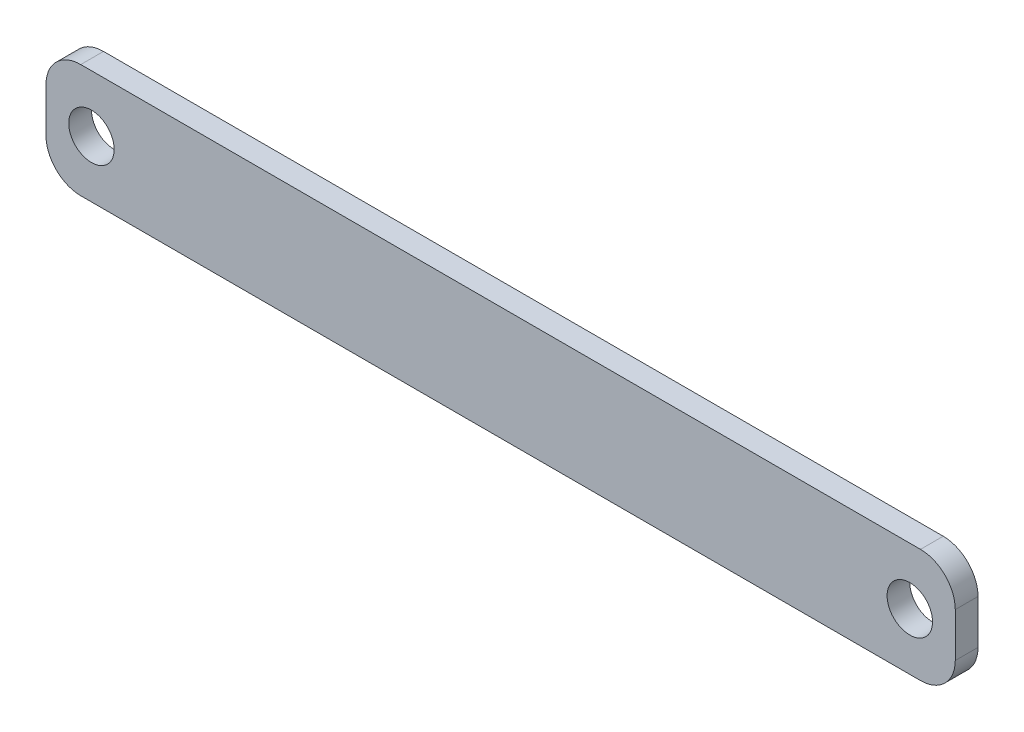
ISO-10303-21;
HEADER;
FILE_DESCRIPTION(('STEP AP214'),'2;1');
FILE_NAME('part.step','',(''),(''),'','','');
FILE_SCHEMA(('AUTOMOTIVE_DESIGN { 1 0 10303 214 1 1 1 1 }'));
ENDSEC;
DATA;
#1=APPLICATION_CONTEXT('core data for automotive mechanical design processes');
#2=APPLICATION_PROTOCOL_DEFINITION('international standard','automotive_design',2000,#1);
#3=PRODUCT_CONTEXT('',#1,'mechanical');
#4=PRODUCT('Part','Part','',(#3));
#5=PRODUCT_RELATED_PRODUCT_CATEGORY('part','',(#4));
#6=PRODUCT_DEFINITION_FORMATION('','',#4);
#7=PRODUCT_DEFINITION_CONTEXT('part definition',#1,'design');
#8=PRODUCT_DEFINITION('design','',#6,#7);
#9=PRODUCT_DEFINITION_SHAPE('','',#8);
#10=(LENGTH_UNIT() NAMED_UNIT(*) SI_UNIT(.MILLI.,.METRE.));
#11=(NAMED_UNIT(*) PLANE_ANGLE_UNIT() SI_UNIT($,.RADIAN.));
#12=(NAMED_UNIT(*) SI_UNIT($,.STERADIAN.) SOLID_ANGLE_UNIT());
#13=UNCERTAINTY_MEASURE_WITH_UNIT(LENGTH_MEASURE(1.E-05),#10,'distance_accuracy_value','');
#14=(GEOMETRIC_REPRESENTATION_CONTEXT(3) GLOBAL_UNCERTAINTY_ASSIGNED_CONTEXT((#13)) GLOBAL_UNIT_ASSIGNED_CONTEXT((#10,
#11,#12)) REPRESENTATION_CONTEXT('',''));
#15=CARTESIAN_POINT('',(0.,0.,0.));
#16=DIRECTION('',(0.,0.,1.));
#17=DIRECTION('',(1.,0.,0.));
#18=AXIS2_PLACEMENT_3D('',#15,#16,#17);
#19=CARTESIAN_POINT('',(-50.8,0.,2.54));
#20=DIRECTION('',(-1.,0.,0.));
#21=DIRECTION('',(0.,0.,1.));
#22=AXIS2_PLACEMENT_3D('',#19,#20,#21);
#23=PLANE('',#22);
#24=DIRECTION('',(0.,1.,0.));
#25=VECTOR('',#24,1.);
#26=CARTESIAN_POINT('',(-50.8,0.,0.));
#27=LINE('',#26,#25);
#28=CARTESIAN_POINT('',(-50.8,3.8862,0.));
#29=VERTEX_POINT('',#28);
#30=CARTESIAN_POINT('',(-50.8,8.8138,0.));
#31=VERTEX_POINT('',#30);
#32=EDGE_CURVE('E131',#29,#31,#27,.T.);
#33=ORIENTED_EDGE('',*,*,#32,.F.);
#34=DIRECTION('',(0.,0.,-1.));
#35=VECTOR('',#34,1.);
#36=CARTESIAN_POINT('',(-50.8,3.8862,2.54));
#37=LINE('',#36,#35);
#38=CARTESIAN_POINT('',(-50.8,3.8862,2.54));
#39=VERTEX_POINT('',#38);
#40=EDGE_CURVE('E107',#29,#39,#37,.F.);
#41=ORIENTED_EDGE('',*,*,#40,.T.);
#42=DIRECTION('',(0.,1.,0.));
#43=VECTOR('',#42,1.);
#44=CARTESIAN_POINT('',(-50.8,0.,2.54));
#45=LINE('',#44,#43);
#46=CARTESIAN_POINT('',(-50.8,8.8138,2.54));
#47=VERTEX_POINT('',#46);
#48=EDGE_CURVE('E147',#39,#47,#45,.T.);
#49=ORIENTED_EDGE('',*,*,#48,.T.);
#50=DIRECTION('',(0.,0.,-1.));
#51=VECTOR('',#50,1.);
#52=CARTESIAN_POINT('',(-50.8,8.8138,2.54));
#53=LINE('',#52,#51);
#54=EDGE_CURVE('E112',#47,#31,#53,.T.);
#55=ORIENTED_EDGE('',*,*,#54,.T.);
#56=EDGE_LOOP('',(#33,#41,#49,#55));
#57=FACE_BOUND('',#56,.T.);
#58=ADVANCED_FACE('F35',(#57),#23,.T.);
#59=CARTESIAN_POINT('',(0.,0.,2.54));
#60=DIRECTION('',(0.,1.,0.));
#61=DIRECTION('',(0.,0.,1.));
#62=AXIS2_PLACEMENT_3D('',#59,#60,#61);
#63=PLANE('',#62);
#64=DIRECTION('',(1.,0.,0.));
#65=VECTOR('',#64,1.);
#66=CARTESIAN_POINT('',(0.,0.,2.54));
#67=LINE('',#66,#65);
#68=CARTESIAN_POINT('',(-46.9138,0.,2.54));
#69=VERTEX_POINT('',#68);
#70=CARTESIAN_POINT('',(46.9138,0.,2.54));
#71=VERTEX_POINT('',#70);
#72=EDGE_CURVE('E122',#69,#71,#67,.T.);
#73=ORIENTED_EDGE('',*,*,#72,.F.);
#74=DIRECTION('',(0.,0.,-1.));
#75=VECTOR('',#74,1.);
#76=CARTESIAN_POINT('',(-46.9138,0.,0.));
#77=LINE('',#76,#75);
#78=CARTESIAN_POINT('',(-46.9138,0.,0.));
#79=VERTEX_POINT('',#78);
#80=EDGE_CURVE('E106',#69,#79,#77,.T.);
#81=ORIENTED_EDGE('',*,*,#80,.T.);
#82=DIRECTION('',(1.,0.,0.));
#83=VECTOR('',#82,1.);
#84=CARTESIAN_POINT('',(0.,0.,0.));
#85=LINE('',#84,#83);
#86=CARTESIAN_POINT('',(46.9138,0.,0.));
#87=VERTEX_POINT('',#86);
#88=EDGE_CURVE('E119',#79,#87,#85,.T.);
#89=ORIENTED_EDGE('',*,*,#88,.T.);
#90=DIRECTION('',(0.,0.,-1.));
#91=VECTOR('',#90,1.);
#92=CARTESIAN_POINT('',(46.9138,0.,2.54));
#93=LINE('',#92,#91);
#94=EDGE_CURVE('E124',#87,#71,#93,.F.);
#95=ORIENTED_EDGE('',*,*,#94,.T.);
#96=EDGE_LOOP('',(#73,#81,#89,#95));
#97=FACE_BOUND('',#96,.T.);
#98=ADVANCED_FACE('F118',(#97),#63,.F.);
#99=CARTESIAN_POINT('',(50.8,0.,2.54));
#100=DIRECTION('',(-1.,0.,0.));
#101=DIRECTION('',(0.,0.,1.));
#102=AXIS2_PLACEMENT_3D('',#99,#100,#101);
#103=PLANE('',#102);
#104=DIRECTION('',(0.,1.,0.));
#105=VECTOR('',#104,1.);
#106=CARTESIAN_POINT('',(50.8,0.,2.54));
#107=LINE('',#106,#105);
#108=CARTESIAN_POINT('',(50.8,3.8862,2.54));
#109=VERTEX_POINT('',#108);
#110=CARTESIAN_POINT('',(50.8,8.8138,2.54));
#111=VERTEX_POINT('',#110);
#112=EDGE_CURVE('E170',#109,#111,#107,.T.);
#113=ORIENTED_EDGE('',*,*,#112,.F.);
#114=DIRECTION('',(0.,0.,-1.));
#115=VECTOR('',#114,1.);
#116=CARTESIAN_POINT('',(50.8,3.8862,2.54));
#117=LINE('',#116,#115);
#118=CARTESIAN_POINT('',(50.8,3.8862,0.));
#119=VERTEX_POINT('',#118);
#120=EDGE_CURVE('E11',#109,#119,#117,.T.);
#121=ORIENTED_EDGE('',*,*,#120,.T.);
#122=DIRECTION('',(0.,1.,0.));
#123=VECTOR('',#122,1.);
#124=CARTESIAN_POINT('',(50.8,0.,0.));
#125=LINE('',#124,#123);
#126=CARTESIAN_POINT('',(50.8,8.8138,0.));
#127=VERTEX_POINT('',#126);
#128=EDGE_CURVE('E130',#119,#127,#125,.T.);
#129=ORIENTED_EDGE('',*,*,#128,.T.);
#130=DIRECTION('',(0.,0.,-1.));
#131=VECTOR('',#130,1.);
#132=CARTESIAN_POINT('',(50.8,8.8138,2.54));
#133=LINE('',#132,#131);
#134=EDGE_CURVE('E43',#127,#111,#133,.F.);
#135=ORIENTED_EDGE('',*,*,#134,.T.);
#136=EDGE_LOOP('',(#113,#121,#129,#135));
#137=FACE_BOUND('',#136,.T.);
#138=ADVANCED_FACE('F169',(#137),#103,.F.);
#139=CARTESIAN_POINT('',(-45.72,6.35,2.54));
#140=DIRECTION('',(0.,0.,-1.));
#141=DIRECTION('',(-1.,0.,0.));
#142=AXIS2_PLACEMENT_3D('',#139,#140,#141);
#143=CYLINDRICAL_SURFACE('',#142,2.54);
#144=CARTESIAN_POINT('',(-45.72,6.35,2.54));
#145=DIRECTION('',(0.,0.,1.));
#146=DIRECTION('',(1.,0.,0.));
#147=AXIS2_PLACEMENT_3D('',#144,#145,#146);
#148=CIRCLE('',#147,2.54);
#149=CARTESIAN_POINT('',(-43.18,6.35,2.54));
#150=VERTEX_POINT('',#149);
#151=EDGE_CURVE('E191',#150,#150,#148,.F.);
#152=ORIENTED_EDGE('',*,*,#151,.F.);
#153=EDGE_LOOP('',(#152));
#154=FACE_BOUND('',#153,.T.);
#155=CARTESIAN_POINT('',(-45.72,6.35,0.));
#156=DIRECTION('',(0.,0.,1.));
#157=DIRECTION('',(1.,0.,0.));
#158=AXIS2_PLACEMENT_3D('',#155,#156,#157);
#159=CIRCLE('',#158,2.54);
#160=CARTESIAN_POINT('',(-43.18,6.35,0.));
#161=VERTEX_POINT('',#160);
#162=EDGE_CURVE('E141',#161,#161,#159,.F.);
#163=ORIENTED_EDGE('',*,*,#162,.T.);
#164=EDGE_LOOP('',(#163));
#165=FACE_BOUND('',#164,.T.);
#166=ADVANCED_FACE('F263',(#154,#165),#143,.F.);
#167=CARTESIAN_POINT('',(0.,12.7,2.54));
#168=DIRECTION('',(0.,1.,0.));
#169=DIRECTION('',(0.,0.,1.));
#170=AXIS2_PLACEMENT_3D('',#167,#168,#169);
#171=PLANE('',#170);
#172=DIRECTION('',(1.,0.,0.));
#173=VECTOR('',#172,1.);
#174=CARTESIAN_POINT('',(0.,12.7,0.));
#175=LINE('',#174,#173);
#176=CARTESIAN_POINT('',(-46.9138,12.7,0.));
#177=VERTEX_POINT('',#176);
#178=CARTESIAN_POINT('',(46.9138,12.7,0.));
#179=VERTEX_POINT('',#178);
#180=EDGE_CURVE('E134',#177,#179,#175,.T.);
#181=ORIENTED_EDGE('',*,*,#180,.F.);
#182=DIRECTION('',(0.,0.,-1.));
#183=VECTOR('',#182,1.);
#184=CARTESIAN_POINT('',(-46.9138,12.7,2.54));
#185=LINE('',#184,#183);
#186=CARTESIAN_POINT('',(-46.9138,12.7,2.54));
#187=VERTEX_POINT('',#186);
#188=EDGE_CURVE('E57',#177,#187,#185,.F.);
#189=ORIENTED_EDGE('',*,*,#188,.T.);
#190=DIRECTION('',(1.,0.,0.));
#191=VECTOR('',#190,1.);
#192=CARTESIAN_POINT('',(0.,12.7,2.54));
#193=LINE('',#192,#191);
#194=CARTESIAN_POINT('',(46.9138,12.7,2.54));
#195=VERTEX_POINT('',#194);
#196=EDGE_CURVE('E177',#187,#195,#193,.T.);
#197=ORIENTED_EDGE('',*,*,#196,.T.);
#198=DIRECTION('',(0.,0.,-1.));
#199=VECTOR('',#198,1.);
#200=CARTESIAN_POINT('',(46.9138,12.7,0.));
#201=LINE('',#200,#199);
#202=EDGE_CURVE('E163',#195,#179,#201,.T.);
#203=ORIENTED_EDGE('',*,*,#202,.T.);
#204=EDGE_LOOP('',(#181,#189,#197,#203));
#205=FACE_BOUND('',#204,.T.);
#206=ADVANCED_FACE('F180',(#205),#171,.T.);
#207=CARTESIAN_POINT('',(45.72,6.35,2.54));
#208=DIRECTION('',(0.,0.,-1.));
#209=DIRECTION('',(-1.,0.,0.));
#210=AXIS2_PLACEMENT_3D('',#207,#208,#209);
#211=CYLINDRICAL_SURFACE('',#210,2.54);
#212=CARTESIAN_POINT('',(45.72,6.35,2.54));
#213=DIRECTION('',(0.,0.,1.));
#214=DIRECTION('',(1.,0.,0.));
#215=AXIS2_PLACEMENT_3D('',#212,#213,#214);
#216=CIRCLE('',#215,2.54);
#217=CARTESIAN_POINT('',(48.26,6.35,2.54));
#218=VERTEX_POINT('',#217);
#219=EDGE_CURVE('E148',#218,#218,#216,.T.);
#220=ORIENTED_EDGE('',*,*,#219,.T.);
#221=EDGE_LOOP('',(#220));
#222=FACE_BOUND('',#221,.T.);
#223=CARTESIAN_POINT('',(45.72,6.35,0.));
#224=DIRECTION('',(0.,0.,1.));
#225=DIRECTION('',(1.,0.,0.));
#226=AXIS2_PLACEMENT_3D('',#223,#224,#225);
#227=CIRCLE('',#226,2.54);
#228=CARTESIAN_POINT('',(48.26,6.35,0.));
#229=VERTEX_POINT('',#228);
#230=EDGE_CURVE('E144',#229,#229,#227,.T.);
#231=ORIENTED_EDGE('',*,*,#230,.F.);
#232=EDGE_LOOP('',(#231));
#233=FACE_BOUND('',#232,.T.);
#234=ADVANCED_FACE('F196',(#222,#233),#211,.F.);
#235=CARTESIAN_POINT('',(0.,0.,2.54));
#236=DIRECTION('',(0.,0.,1.));
#237=DIRECTION('',(1.,0.,0.));
#238=AXIS2_PLACEMENT_3D('',#235,#236,#237);
#239=PLANE('',#238);
#240=ORIENTED_EDGE('',*,*,#48,.F.);
#241=CARTESIAN_POINT('',(-46.9138,3.8862,2.54));
#242=DIRECTION('',(0.,0.,1.));
#243=DIRECTION('',(1.,0.,0.));
#244=AXIS2_PLACEMENT_3D('',#241,#242,#243);
#245=CIRCLE('',#244,3.8862);
#246=EDGE_CURVE('E161',#39,#69,#245,.T.);
#247=ORIENTED_EDGE('',*,*,#246,.T.);
#248=ORIENTED_EDGE('',*,*,#72,.T.);
#249=CARTESIAN_POINT('',(46.9138,3.8862,2.54));
#250=DIRECTION('',(0.,0.,1.));
#251=DIRECTION('',(1.,0.,0.));
#252=AXIS2_PLACEMENT_3D('',#249,#250,#251);
#253=CIRCLE('',#252,3.8862);
#254=EDGE_CURVE('E157',#71,#109,#253,.T.);
#255=ORIENTED_EDGE('',*,*,#254,.T.);
#256=ORIENTED_EDGE('',*,*,#112,.T.);
#257=CARTESIAN_POINT('',(46.9138,8.8138,2.54));
#258=DIRECTION('',(0.,0.,1.));
#259=DIRECTION('',(1.,0.,0.));
#260=AXIS2_PLACEMENT_3D('',#257,#258,#259);
#261=CIRCLE('',#260,3.8862);
#262=EDGE_CURVE('E50',#111,#195,#261,.T.);
#263=ORIENTED_EDGE('',*,*,#262,.T.);
#264=ORIENTED_EDGE('',*,*,#196,.F.);
#265=CARTESIAN_POINT('',(-46.9138,8.8138,2.54));
#266=DIRECTION('',(0.,0.,1.));
#267=DIRECTION('',(1.,0.,0.));
#268=AXIS2_PLACEMENT_3D('',#265,#266,#267);
#269=CIRCLE('',#268,3.8862);
#270=EDGE_CURVE('E159',#187,#47,#269,.T.);
#271=ORIENTED_EDGE('',*,*,#270,.T.);
#272=EDGE_LOOP('',(#240,#247,#248,#255,#256,#263,#264,#271));
#273=FACE_BOUND('',#272,.T.);
#274=ORIENTED_EDGE('',*,*,#151,.T.);
#275=EDGE_LOOP('',(#274));
#276=FACE_BOUND('',#275,.T.);
#277=ORIENTED_EDGE('',*,*,#219,.F.);
#278=EDGE_LOOP('',(#277));
#279=FACE_BOUND('',#278,.T.);
#280=ADVANCED_FACE('F174',(#273,#276,#279),#239,.T.);
#281=CARTESIAN_POINT('',(0.,0.,0.));
#282=DIRECTION('',(0.,0.,1.));
#283=DIRECTION('',(1.,0.,0.));
#284=AXIS2_PLACEMENT_3D('',#281,#282,#283);
#285=PLANE('',#284);
#286=ORIENTED_EDGE('',*,*,#88,.F.);
#287=CARTESIAN_POINT('',(-46.9138,3.8862,0.));
#288=DIRECTION('',(0.,0.,1.));
#289=DIRECTION('',(1.,0.,0.));
#290=AXIS2_PLACEMENT_3D('',#287,#288,#289);
#291=CIRCLE('',#290,3.8862);
#292=EDGE_CURVE('E102',#79,#29,#291,.F.);
#293=ORIENTED_EDGE('',*,*,#292,.T.);
#294=ORIENTED_EDGE('',*,*,#32,.T.);
#295=CARTESIAN_POINT('',(-46.9138,8.8138,0.));
#296=DIRECTION('',(0.,0.,1.));
#297=DIRECTION('',(1.,0.,0.));
#298=AXIS2_PLACEMENT_3D('',#295,#296,#297);
#299=CIRCLE('',#298,3.8862);
#300=EDGE_CURVE('E113',#31,#177,#299,.F.);
#301=ORIENTED_EDGE('',*,*,#300,.T.);
#302=ORIENTED_EDGE('',*,*,#180,.T.);
#303=CARTESIAN_POINT('',(46.9138,8.8138,0.));
#304=DIRECTION('',(0.,0.,1.));
#305=DIRECTION('',(1.,0.,0.));
#306=AXIS2_PLACEMENT_3D('',#303,#304,#305);
#307=CIRCLE('',#306,3.8862);
#308=EDGE_CURVE('E123',#179,#127,#307,.F.);
#309=ORIENTED_EDGE('',*,*,#308,.T.);
#310=ORIENTED_EDGE('',*,*,#128,.F.);
#311=CARTESIAN_POINT('',(46.9138,3.8862,0.));
#312=DIRECTION('',(0.,0.,1.));
#313=DIRECTION('',(1.,0.,0.));
#314=AXIS2_PLACEMENT_3D('',#311,#312,#313);
#315=CIRCLE('',#314,3.8862);
#316=EDGE_CURVE('E129',#119,#87,#315,.F.);
#317=ORIENTED_EDGE('',*,*,#316,.T.);
#318=EDGE_LOOP('',(#286,#293,#294,#301,#302,#309,#310,#317));
#319=FACE_BOUND('',#318,.T.);
#320=ORIENTED_EDGE('',*,*,#162,.F.);
#321=EDGE_LOOP('',(#320));
#322=FACE_BOUND('',#321,.T.);
#323=ORIENTED_EDGE('',*,*,#230,.T.);
#324=EDGE_LOOP('',(#323));
#325=FACE_BOUND('',#324,.T.);
#326=ADVANCED_FACE('F126',(#319,#322,#325),#285,.F.);
#327=CARTESIAN_POINT('',(-46.9138,3.8862,2.54));
#328=DIRECTION('',(0.,0.,1.));
#329=DIRECTION('',(1.,0.,0.));
#330=AXIS2_PLACEMENT_3D('',#327,#328,#329);
#331=CYLINDRICAL_SURFACE('',#330,3.8862);
#332=ORIENTED_EDGE('',*,*,#246,.F.);
#333=ORIENTED_EDGE('',*,*,#40,.F.);
#334=ORIENTED_EDGE('',*,*,#292,.F.);
#335=ORIENTED_EDGE('',*,*,#80,.F.);
#336=EDGE_LOOP('',(#332,#333,#334,#335));
#337=FACE_BOUND('',#336,.T.);
#338=ADVANCED_FACE('F105',(#337),#331,.T.);
#339=CARTESIAN_POINT('',(-46.9138,8.8138,2.54));
#340=DIRECTION('',(0.,0.,-1.));
#341=DIRECTION('',(-1.,0.,0.));
#342=AXIS2_PLACEMENT_3D('',#339,#340,#341);
#343=CYLINDRICAL_SURFACE('',#342,3.8862);
#344=ORIENTED_EDGE('',*,*,#270,.F.);
#345=ORIENTED_EDGE('',*,*,#188,.F.);
#346=ORIENTED_EDGE('',*,*,#300,.F.);
#347=ORIENTED_EDGE('',*,*,#54,.F.);
#348=EDGE_LOOP('',(#344,#345,#346,#347));
#349=FACE_BOUND('',#348,.T.);
#350=ADVANCED_FACE('F184',(#349),#343,.T.);
#351=CARTESIAN_POINT('',(46.9138,3.8862,2.54));
#352=DIRECTION('',(0.,0.,-1.));
#353=DIRECTION('',(-1.,0.,0.));
#354=AXIS2_PLACEMENT_3D('',#351,#352,#353);
#355=CYLINDRICAL_SURFACE('',#354,3.8862);
#356=ORIENTED_EDGE('',*,*,#254,.F.);
#357=ORIENTED_EDGE('',*,*,#94,.F.);
#358=ORIENTED_EDGE('',*,*,#316,.F.);
#359=ORIENTED_EDGE('',*,*,#120,.F.);
#360=EDGE_LOOP('',(#356,#357,#358,#359));
#361=FACE_BOUND('',#360,.T.);
#362=ADVANCED_FACE('F218',(#361),#355,.T.);
#363=CARTESIAN_POINT('',(46.9138,8.8138,2.54));
#364=DIRECTION('',(0.,0.,1.));
#365=DIRECTION('',(1.,0.,0.));
#366=AXIS2_PLACEMENT_3D('',#363,#364,#365);
#367=CYLINDRICAL_SURFACE('',#366,3.8862);
#368=ORIENTED_EDGE('',*,*,#262,.F.);
#369=ORIENTED_EDGE('',*,*,#134,.F.);
#370=ORIENTED_EDGE('',*,*,#308,.F.);
#371=ORIENTED_EDGE('',*,*,#202,.F.);
#372=EDGE_LOOP('',(#368,#369,#370,#371));
#373=FACE_BOUND('',#372,.T.);
#374=ADVANCED_FACE('F37',(#373),#367,.T.);
#375=CLOSED_SHELL('',(#58,#98,#138,#166,#206,#234,#280,#326,#338,#350,#362,#374));
#376=MANIFOLD_SOLID_BREP('B2',#375);
#377=ADVANCED_BREP_SHAPE_REPRESENTATION('',(#18,#376),#14);
#378=SHAPE_DEFINITION_REPRESENTATION(#9,#377);
ENDSEC;
END-ISO-10303-21;
